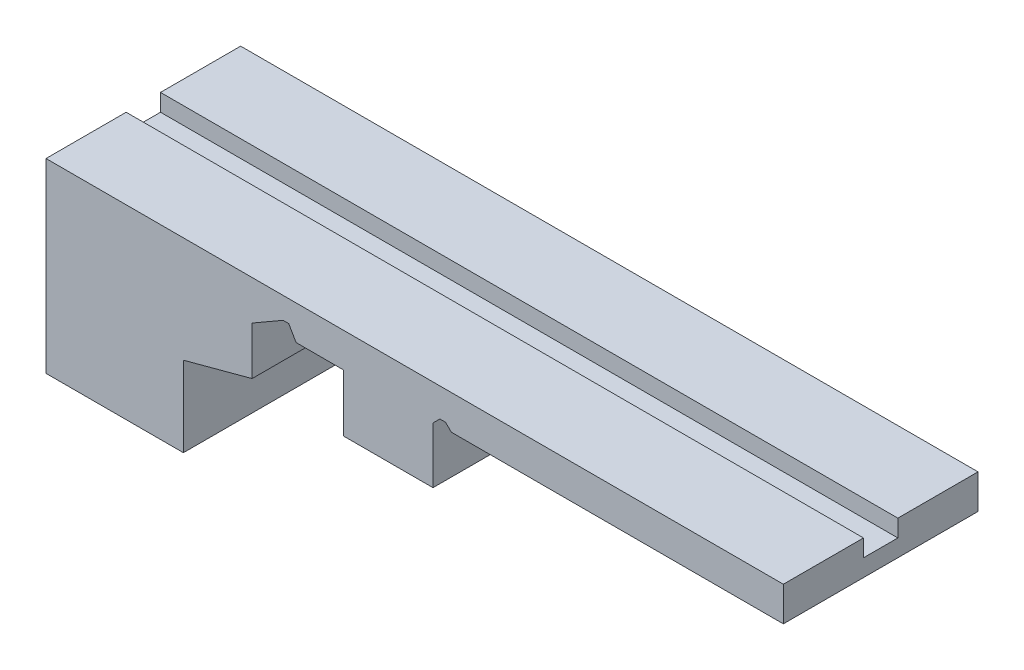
ISO-10303-21;
HEADER;
FILE_DESCRIPTION(('STEP AP214'),'2;1');
FILE_NAME('part.step','',(''),(''),'','','');
FILE_SCHEMA(('AUTOMOTIVE_DESIGN { 1 0 10303 214 1 1 1 1 }'));
ENDSEC;
DATA;
#1=APPLICATION_CONTEXT('core data for automotive mechanical design processes');
#2=APPLICATION_PROTOCOL_DEFINITION('international standard','automotive_design',2000,#1);
#3=PRODUCT_CONTEXT('',#1,'mechanical');
#4=PRODUCT('Part','Part','',(#3));
#5=PRODUCT_RELATED_PRODUCT_CATEGORY('part','',(#4));
#6=PRODUCT_DEFINITION_FORMATION('','',#4);
#7=PRODUCT_DEFINITION_CONTEXT('part definition',#1,'design');
#8=PRODUCT_DEFINITION('design','',#6,#7);
#9=PRODUCT_DEFINITION_SHAPE('','',#8);
#10=(LENGTH_UNIT() NAMED_UNIT(*) SI_UNIT(.MILLI.,.METRE.));
#11=(NAMED_UNIT(*) PLANE_ANGLE_UNIT() SI_UNIT($,.RADIAN.));
#12=(NAMED_UNIT(*) SI_UNIT($,.STERADIAN.) SOLID_ANGLE_UNIT());
#13=UNCERTAINTY_MEASURE_WITH_UNIT(LENGTH_MEASURE(1.E-05),#10,'distance_accuracy_value','');
#14=(GEOMETRIC_REPRESENTATION_CONTEXT(3) GLOBAL_UNCERTAINTY_ASSIGNED_CONTEXT((#13)) GLOBAL_UNIT_ASSIGNED_CONTEXT((#10,
#11,#12)) REPRESENTATION_CONTEXT('',''));
#15=CARTESIAN_POINT('',(0.,0.,0.));
#16=DIRECTION('',(0.,0.,1.));
#17=DIRECTION('',(1.,0.,0.));
#18=AXIS2_PLACEMENT_3D('',#15,#16,#17);
#19=CARTESIAN_POINT('',(-309.002649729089,30.,170.));
#20=DIRECTION('',(0.,-1.,0.));
#21=DIRECTION('',(0.,0.,-1.));
#22=AXIS2_PLACEMENT_3D('',#19,#20,#21);
#23=PLANE('',#22);
#24=DIRECTION('',(0.,0.,-1.));
#25=VECTOR('',#24,1.);
#26=CARTESIAN_POINT('',(-309.002649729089,30.,170.));
#27=LINE('',#26,#25);
#28=CARTESIAN_POINT('',(-309.002649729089,30.,70.));
#29=VERTEX_POINT('',#28);
#30=CARTESIAN_POINT('',(-309.002649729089,30.,0.));
#31=VERTEX_POINT('',#30);
#32=EDGE_CURVE('E318',#29,#31,#27,.T.);
#33=ORIENTED_EDGE('',*,*,#32,.F.);
#34=DIRECTION('',(-1.,0.,0.));
#35=VECTOR('',#34,1.);
#36=CARTESIAN_POINT('',(335.,30.,70.));
#37=LINE('',#36,#35);
#38=CARTESIAN_POINT('',(335.,30.,70.));
#39=VERTEX_POINT('',#38);
#40=EDGE_CURVE('E213',#39,#29,#37,.T.);
#41=ORIENTED_EDGE('',*,*,#40,.F.);
#42=DIRECTION('',(0.,0.,-1.));
#43=VECTOR('',#42,1.);
#44=CARTESIAN_POINT('',(335.,30.,170.));
#45=LINE('',#44,#43);
#46=CARTESIAN_POINT('',(335.,30.,0.));
#47=VERTEX_POINT('',#46);
#48=EDGE_CURVE('E320',#39,#47,#45,.T.);
#49=ORIENTED_EDGE('',*,*,#48,.T.);
#50=DIRECTION('',(-1.,0.,0.));
#51=VECTOR('',#50,1.);
#52=CARTESIAN_POINT('',(-309.002649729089,30.,0.));
#53=LINE('',#52,#51);
#54=EDGE_CURVE('E235',#47,#31,#53,.T.);
#55=ORIENTED_EDGE('',*,*,#54,.T.);
#56=EDGE_LOOP('',(#33,#41,#49,#55));
#57=FACE_BOUND('',#56,.T.);
#58=ADVANCED_FACE('F31',(#57),#23,.F.);
#59=CARTESIAN_POINT('',(-49.,-50.,170.));
#60=DIRECTION('',(1.,0.,0.));
#61=DIRECTION('',(0.,0.,-1.));
#62=AXIS2_PLACEMENT_3D('',#59,#60,#61);
#63=PLANE('',#62);
#64=DIRECTION('',(0.,-1.,0.));
#65=VECTOR('',#64,1.);
#66=CARTESIAN_POINT('',(-49.,-50.,0.));
#67=LINE('',#66,#65);
#68=CARTESIAN_POINT('',(-49.,0.,0.));
#69=VERTEX_POINT('',#68);
#70=CARTESIAN_POINT('',(-49.,-50.,0.));
#71=VERTEX_POINT('',#70);
#72=EDGE_CURVE('E215',#69,#71,#67,.T.);
#73=ORIENTED_EDGE('',*,*,#72,.T.);
#74=DIRECTION('',(0.,0.,-1.));
#75=VECTOR('',#74,1.);
#76=CARTESIAN_POINT('',(-49.,-50.,170.));
#77=LINE('',#76,#75);
#78=CARTESIAN_POINT('',(-49.,-50.,170.));
#79=VERTEX_POINT('',#78);
#80=EDGE_CURVE('E11',#79,#71,#77,.T.);
#81=ORIENTED_EDGE('',*,*,#80,.F.);
#82=DIRECTION('',(0.,-1.,0.));
#83=VECTOR('',#82,1.);
#84=CARTESIAN_POINT('',(-49.,-50.,170.));
#85=LINE('',#84,#83);
#86=CARTESIAN_POINT('',(-49.,0.,170.));
#87=VERTEX_POINT('',#86);
#88=EDGE_CURVE('E256',#87,#79,#85,.T.);
#89=ORIENTED_EDGE('',*,*,#88,.F.);
#90=DIRECTION('',(0.,0.,-1.));
#91=VECTOR('',#90,1.);
#92=CARTESIAN_POINT('',(-49.,0.,170.));
#93=LINE('',#92,#91);
#94=EDGE_CURVE('E291',#87,#69,#93,.T.);
#95=ORIENTED_EDGE('',*,*,#94,.T.);
#96=EDGE_LOOP('',(#73,#81,#89,#95));
#97=FACE_BOUND('',#96,.T.);
#98=ADVANCED_FACE('F33',(#97),#63,.F.);
#99=CARTESIAN_POINT('',(-49.,-50.,170.));
#100=DIRECTION('',(0.,1.,0.));
#101=DIRECTION('',(0.,0.,1.));
#102=AXIS2_PLACEMENT_3D('',#99,#100,#101);
#103=PLANE('',#102);
#104=DIRECTION('',(1.,0.,0.));
#105=VECTOR('',#104,1.);
#106=CARTESIAN_POINT('',(-49.,-50.,0.));
#107=LINE('',#106,#105);
#108=CARTESIAN_POINT('',(29.,-50.,0.));
#109=VERTEX_POINT('',#108);
#110=EDGE_CURVE('E220',#71,#109,#107,.T.);
#111=ORIENTED_EDGE('',*,*,#110,.T.);
#112=DIRECTION('',(0.,0.,-1.));
#113=VECTOR('',#112,1.);
#114=CARTESIAN_POINT('',(29.,-50.,170.));
#115=LINE('',#114,#113);
#116=CARTESIAN_POINT('',(29.,-50.,170.));
#117=VERTEX_POINT('',#116);
#118=EDGE_CURVE('E39',#117,#109,#115,.T.);
#119=ORIENTED_EDGE('',*,*,#118,.F.);
#120=DIRECTION('',(1.,0.,0.));
#121=VECTOR('',#120,1.);
#122=CARTESIAN_POINT('',(-49.,-50.,170.));
#123=LINE('',#122,#121);
#124=EDGE_CURVE('E258',#79,#117,#123,.T.);
#125=ORIENTED_EDGE('',*,*,#124,.F.);
#126=ORIENTED_EDGE('',*,*,#80,.T.);
#127=EDGE_LOOP('',(#111,#119,#125,#126));
#128=FACE_BOUND('',#127,.T.);
#129=ADVANCED_FACE('F365',(#128),#103,.F.);
#130=CARTESIAN_POINT('',(29.,-50.,170.));
#131=DIRECTION('',(-1.,0.,0.));
#132=DIRECTION('',(0.,0.,1.));
#133=AXIS2_PLACEMENT_3D('',#130,#131,#132);
#134=PLANE('',#133);
#135=DIRECTION('',(0.,1.,0.));
#136=VECTOR('',#135,1.);
#137=CARTESIAN_POINT('',(29.,-50.,0.));
#138=LINE('',#137,#136);
#139=CARTESIAN_POINT('',(29.,-0.999999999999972,0.));
#140=VERTEX_POINT('',#139);
#141=EDGE_CURVE('E222',#109,#140,#138,.T.);
#142=ORIENTED_EDGE('',*,*,#141,.T.);
#143=DIRECTION('',(0.,0.,-1.));
#144=VECTOR('',#143,1.);
#145=CARTESIAN_POINT('',(29.,-0.999999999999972,170.));
#146=LINE('',#145,#144);
#147=CARTESIAN_POINT('',(29.,-0.999999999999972,170.));
#148=VERTEX_POINT('',#147);
#149=EDGE_CURVE('E336',#148,#140,#146,.T.);
#150=ORIENTED_EDGE('',*,*,#149,.F.);
#151=DIRECTION('',(0.,1.,0.));
#152=VECTOR('',#151,1.);
#153=CARTESIAN_POINT('',(29.,-50.,170.));
#154=LINE('',#153,#152);
#155=EDGE_CURVE('E260',#117,#148,#154,.T.);
#156=ORIENTED_EDGE('',*,*,#155,.F.);
#157=ORIENTED_EDGE('',*,*,#118,.T.);
#158=EDGE_LOOP('',(#142,#150,#156,#157));
#159=FACE_BOUND('',#158,.T.);
#160=ADVANCED_FACE('F343',(#159),#134,.F.);
#161=CARTESIAN_POINT('',(29.,-0.999999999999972,170.));
#162=DIRECTION('',(-0.707106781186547,0.707106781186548,0.));
#163=DIRECTION('',(-0.707106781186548,-0.707106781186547,0.));
#164=AXIS2_PLACEMENT_3D('',#161,#162,#163);
#165=PLANE('',#164);
#166=DIRECTION('',(0.707106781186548,0.707106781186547,0.));
#167=VECTOR('',#166,1.);
#168=CARTESIAN_POINT('',(29.,-0.999999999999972,0.));
#169=LINE('',#168,#167);
#170=CARTESIAN_POINT('',(35.,5.00000000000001,0.));
#171=VERTEX_POINT('',#170);
#172=EDGE_CURVE('E224',#140,#171,#169,.T.);
#173=ORIENTED_EDGE('',*,*,#172,.T.);
#174=DIRECTION('',(0.,0.,-1.));
#175=VECTOR('',#174,1.);
#176=CARTESIAN_POINT('',(35.,5.00000000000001,170.));
#177=LINE('',#176,#175);
#178=CARTESIAN_POINT('',(35.,5.00000000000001,170.));
#179=VERTEX_POINT('',#178);
#180=EDGE_CURVE('E333',#179,#171,#177,.T.);
#181=ORIENTED_EDGE('',*,*,#180,.F.);
#182=DIRECTION('',(0.707106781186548,0.707106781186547,0.));
#183=VECTOR('',#182,1.);
#184=CARTESIAN_POINT('',(29.,-0.999999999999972,170.));
#185=LINE('',#184,#183);
#186=EDGE_CURVE('E262',#148,#179,#185,.T.);
#187=ORIENTED_EDGE('',*,*,#186,.F.);
#188=ORIENTED_EDGE('',*,*,#149,.T.);
#189=EDGE_LOOP('',(#173,#181,#187,#188));
#190=FACE_BOUND('',#189,.T.);
#191=ADVANCED_FACE('F354',(#190),#165,.F.);
#192=CARTESIAN_POINT('',(35.,5.00000000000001,170.));
#193=DIRECTION('',(0.,1.,0.));
#194=DIRECTION('',(0.,0.,1.));
#195=AXIS2_PLACEMENT_3D('',#192,#193,#194);
#196=PLANE('',#195);
#197=DIRECTION('',(1.,0.,0.));
#198=VECTOR('',#197,1.);
#199=CARTESIAN_POINT('',(35.,5.00000000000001,0.));
#200=LINE('',#199,#198);
#201=CARTESIAN_POINT('',(40.,5.00000000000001,0.));
#202=VERTEX_POINT('',#201);
#203=EDGE_CURVE('E226',#171,#202,#200,.T.);
#204=ORIENTED_EDGE('',*,*,#203,.T.);
#205=DIRECTION('',(0.,0.,-1.));
#206=VECTOR('',#205,1.);
#207=CARTESIAN_POINT('',(40.,5.00000000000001,170.));
#208=LINE('',#207,#206);
#209=CARTESIAN_POINT('',(40.,5.00000000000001,170.));
#210=VERTEX_POINT('',#209);
#211=EDGE_CURVE('E330',#210,#202,#208,.T.);
#212=ORIENTED_EDGE('',*,*,#211,.F.);
#213=DIRECTION('',(1.,0.,0.));
#214=VECTOR('',#213,1.);
#215=CARTESIAN_POINT('',(35.,5.00000000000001,170.));
#216=LINE('',#215,#214);
#217=EDGE_CURVE('E264',#179,#210,#216,.T.);
#218=ORIENTED_EDGE('',*,*,#217,.F.);
#219=ORIENTED_EDGE('',*,*,#180,.T.);
#220=EDGE_LOOP('',(#204,#212,#218,#219));
#221=FACE_BOUND('',#220,.T.);
#222=ADVANCED_FACE('F358',(#221),#196,.F.);
#223=CARTESIAN_POINT('',(40.,5.00000000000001,170.));
#224=DIRECTION('',(0.707106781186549,0.707106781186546,0.));
#225=DIRECTION('',(-0.707106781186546,0.707106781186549,0.));
#226=AXIS2_PLACEMENT_3D('',#223,#224,#225);
#227=PLANE('',#226);
#228=DIRECTION('',(0.707106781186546,-0.707106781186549,0.));
#229=VECTOR('',#228,1.);
#230=CARTESIAN_POINT('',(40.,5.00000000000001,0.));
#231=LINE('',#230,#229);
#232=CARTESIAN_POINT('',(45.,0.,0.));
#233=VERTEX_POINT('',#232);
#234=EDGE_CURVE('E228',#202,#233,#231,.T.);
#235=ORIENTED_EDGE('',*,*,#234,.T.);
#236=DIRECTION('',(0.,0.,-1.));
#237=VECTOR('',#236,1.);
#238=CARTESIAN_POINT('',(45.,0.,170.));
#239=LINE('',#238,#237);
#240=CARTESIAN_POINT('',(45.,0.,170.));
#241=VERTEX_POINT('',#240);
#242=EDGE_CURVE('E327',#241,#233,#239,.T.);
#243=ORIENTED_EDGE('',*,*,#242,.F.);
#244=DIRECTION('',(0.707106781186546,-0.707106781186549,0.));
#245=VECTOR('',#244,1.);
#246=CARTESIAN_POINT('',(40.,5.00000000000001,170.));
#247=LINE('',#246,#245);
#248=EDGE_CURVE('E266',#210,#241,#247,.T.);
#249=ORIENTED_EDGE('',*,*,#248,.F.);
#250=ORIENTED_EDGE('',*,*,#211,.T.);
#251=EDGE_LOOP('',(#235,#243,#249,#250));
#252=FACE_BOUND('',#251,.T.);
#253=ADVANCED_FACE('F423',(#252),#227,.F.);
#254=CARTESIAN_POINT('',(45.,0.,170.));
#255=DIRECTION('',(0.,1.,0.));
#256=DIRECTION('',(0.,0.,1.));
#257=AXIS2_PLACEMENT_3D('',#254,#255,#256);
#258=PLANE('',#257);
#259=DIRECTION('',(1.,0.,0.));
#260=VECTOR('',#259,1.);
#261=CARTESIAN_POINT('',(45.,0.,0.));
#262=LINE('',#261,#260);
#263=CARTESIAN_POINT('',(335.,0.,0.));
#264=VERTEX_POINT('',#263);
#265=EDGE_CURVE('E230',#233,#264,#262,.T.);
#266=ORIENTED_EDGE('',*,*,#265,.T.);
#267=DIRECTION('',(0.,0.,-1.));
#268=VECTOR('',#267,1.);
#269=CARTESIAN_POINT('',(335.,0.,170.));
#270=LINE('',#269,#268);
#271=CARTESIAN_POINT('',(335.,0.,170.));
#272=VERTEX_POINT('',#271);
#273=EDGE_CURVE('E324',#272,#264,#270,.T.);
#274=ORIENTED_EDGE('',*,*,#273,.F.);
#275=DIRECTION('',(1.,0.,0.));
#276=VECTOR('',#275,1.);
#277=CARTESIAN_POINT('',(45.,0.,170.));
#278=LINE('',#277,#276);
#279=EDGE_CURVE('E268',#241,#272,#278,.T.);
#280=ORIENTED_EDGE('',*,*,#279,.F.);
#281=ORIENTED_EDGE('',*,*,#242,.T.);
#282=EDGE_LOOP('',(#266,#274,#280,#281));
#283=FACE_BOUND('',#282,.T.);
#284=ADVANCED_FACE('F421',(#283),#258,.F.);
#285=CARTESIAN_POINT('',(335.,30.,170.));
#286=DIRECTION('',(-1.,0.,0.));
#287=DIRECTION('',(0.,0.,1.));
#288=AXIS2_PLACEMENT_3D('',#285,#286,#287);
#289=PLANE('',#288);
#290=ORIENTED_EDGE('',*,*,#48,.F.);
#291=DIRECTION('',(0.,-1.,0.));
#292=VECTOR('',#291,1.);
#293=CARTESIAN_POINT('',(335.,30.,70.));
#294=LINE('',#293,#292);
#295=CARTESIAN_POINT('',(335.,15.,70.));
#296=VERTEX_POINT('',#295);
#297=EDGE_CURVE('E204',#39,#296,#294,.T.);
#298=ORIENTED_EDGE('',*,*,#297,.T.);
#299=DIRECTION('',(0.,0.,1.));
#300=VECTOR('',#299,1.);
#301=CARTESIAN_POINT('',(335.,15.,70.));
#302=LINE('',#301,#300);
#303=CARTESIAN_POINT('',(335.,15.,100.));
#304=VERTEX_POINT('',#303);
#305=EDGE_CURVE('E207',#296,#304,#302,.T.);
#306=ORIENTED_EDGE('',*,*,#305,.T.);
#307=DIRECTION('',(0.,1.,0.));
#308=VECTOR('',#307,1.);
#309=CARTESIAN_POINT('',(335.,30.,100.));
#310=LINE('',#309,#308);
#311=CARTESIAN_POINT('',(335.,30.,100.));
#312=VERTEX_POINT('',#311);
#313=EDGE_CURVE('E187',#304,#312,#310,.T.);
#314=ORIENTED_EDGE('',*,*,#313,.T.);
#315=CARTESIAN_POINT('',(335.,30.,170.));
#316=VERTEX_POINT('',#315);
#317=EDGE_CURVE('E321',#316,#312,#45,.T.);
#318=ORIENTED_EDGE('',*,*,#317,.F.);
#319=DIRECTION('',(0.,1.,0.));
#320=VECTOR('',#319,1.);
#321=CARTESIAN_POINT('',(335.,30.,170.));
#322=LINE('',#321,#320);
#323=EDGE_CURVE('E270',#272,#316,#322,.T.);
#324=ORIENTED_EDGE('',*,*,#323,.F.);
#325=ORIENTED_EDGE('',*,*,#273,.T.);
#326=DIRECTION('',(0.,1.,0.));
#327=VECTOR('',#326,1.);
#328=CARTESIAN_POINT('',(335.,30.,0.));
#329=LINE('',#328,#327);
#330=EDGE_CURVE('E232',#264,#47,#329,.T.);
#331=ORIENTED_EDGE('',*,*,#330,.T.);
#332=EDGE_LOOP('',(#290,#298,#306,#314,#318,#324,#325,#331));
#333=FACE_BOUND('',#332,.T.);
#334=ADVANCED_FACE('F415',(#333),#289,.F.);
#335=ORIENTED_EDGE('',*,*,#317,.T.);
#336=DIRECTION('',(-1.,0.,0.));
#337=VECTOR('',#336,1.);
#338=CARTESIAN_POINT('',(335.,30.,100.));
#339=LINE('',#338,#337);
#340=CARTESIAN_POINT('',(-309.002649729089,30.,100.));
#341=VERTEX_POINT('',#340);
#342=EDGE_CURVE('E191',#312,#341,#339,.T.);
#343=ORIENTED_EDGE('',*,*,#342,.T.);
#344=CARTESIAN_POINT('',(-309.002649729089,30.,170.));
#345=VERTEX_POINT('',#344);
#346=EDGE_CURVE('E203',#345,#341,#27,.T.);
#347=ORIENTED_EDGE('',*,*,#346,.F.);
#348=DIRECTION('',(-1.,0.,0.));
#349=VECTOR('',#348,1.);
#350=CARTESIAN_POINT('',(-309.002649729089,30.,170.));
#351=LINE('',#350,#349);
#352=EDGE_CURVE('E272',#316,#345,#351,.T.);
#353=ORIENTED_EDGE('',*,*,#352,.F.);
#354=EDGE_LOOP('',(#335,#343,#347,#353));
#355=FACE_BOUND('',#354,.T.);
#356=ADVANCED_FACE('F434',(#355),#23,.F.);
#357=CARTESIAN_POINT('',(-309.002649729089,-132.541053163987,170.));
#358=DIRECTION('',(1.,0.,0.));
#359=DIRECTION('',(0.,0.,-1.));
#360=AXIS2_PLACEMENT_3D('',#357,#358,#359);
#361=PLANE('',#360);
#362=DIRECTION('',(0.,0.,1.));
#363=VECTOR('',#362,1.);
#364=CARTESIAN_POINT('',(-309.002649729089,15.,70.));
#365=LINE('',#364,#363);
#366=CARTESIAN_POINT('',(-309.002649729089,15.,70.));
#367=VERTEX_POINT('',#366);
#368=CARTESIAN_POINT('',(-309.002649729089,15.,100.));
#369=VERTEX_POINT('',#368);
#370=EDGE_CURVE('E195',#367,#369,#365,.T.);
#371=ORIENTED_EDGE('',*,*,#370,.F.);
#372=DIRECTION('',(0.,-1.,0.));
#373=VECTOR('',#372,1.);
#374=CARTESIAN_POINT('',(-309.002649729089,30.,70.));
#375=LINE('',#374,#373);
#376=EDGE_CURVE('E46',#29,#367,#375,.T.);
#377=ORIENTED_EDGE('',*,*,#376,.F.);
#378=ORIENTED_EDGE('',*,*,#32,.T.);
#379=DIRECTION('',(0.,-1.,0.));
#380=VECTOR('',#379,1.);
#381=CARTESIAN_POINT('',(-309.002649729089,-132.541053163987,0.));
#382=LINE('',#381,#380);
#383=CARTESIAN_POINT('',(-309.002649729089,-132.541053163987,0.));
#384=VERTEX_POINT('',#383);
#385=EDGE_CURVE('E238',#31,#384,#382,.T.);
#386=ORIENTED_EDGE('',*,*,#385,.T.);
#387=DIRECTION('',(0.,0.,-1.));
#388=VECTOR('',#387,1.);
#389=CARTESIAN_POINT('',(-309.002649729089,-132.541053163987,170.));
#390=LINE('',#389,#388);
#391=CARTESIAN_POINT('',(-309.002649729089,-132.541053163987,170.));
#392=VERTEX_POINT('',#391);
#393=EDGE_CURVE('E315',#392,#384,#390,.T.);
#394=ORIENTED_EDGE('',*,*,#393,.F.);
#395=DIRECTION('',(0.,-1.,0.));
#396=VECTOR('',#395,1.);
#397=CARTESIAN_POINT('',(-309.002649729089,-132.541053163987,170.));
#398=LINE('',#397,#396);
#399=EDGE_CURVE('E274',#345,#392,#398,.T.);
#400=ORIENTED_EDGE('',*,*,#399,.F.);
#401=ORIENTED_EDGE('',*,*,#346,.T.);
#402=DIRECTION('',(0.,1.,0.));
#403=VECTOR('',#402,1.);
#404=CARTESIAN_POINT('',(-309.002649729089,30.,100.));
#405=LINE('',#404,#403);
#406=EDGE_CURVE('E184',#369,#341,#405,.T.);
#407=ORIENTED_EDGE('',*,*,#406,.F.);
#408=EDGE_LOOP('',(#371,#377,#378,#386,#394,#400,#401,#407));
#409=FACE_BOUND('',#408,.T.);
#410=ADVANCED_FACE('F200',(#409),#361,.F.);
#411=CARTESIAN_POINT('',(-189.002649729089,-132.541053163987,170.));
#412=DIRECTION('',(0.,1.,0.));
#413=DIRECTION('',(0.,0.,1.));
#414=AXIS2_PLACEMENT_3D('',#411,#412,#413);
#415=PLANE('',#414);
#416=DIRECTION('',(1.,0.,0.));
#417=VECTOR('',#416,1.);
#418=CARTESIAN_POINT('',(-189.002649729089,-132.541053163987,0.));
#419=LINE('',#418,#417);
#420=CARTESIAN_POINT('',(-189.002649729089,-132.541053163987,0.));
#421=VERTEX_POINT('',#420);
#422=EDGE_CURVE('E240',#384,#421,#419,.T.);
#423=ORIENTED_EDGE('',*,*,#422,.T.);
#424=DIRECTION('',(0.,0.,-1.));
#425=VECTOR('',#424,1.);
#426=CARTESIAN_POINT('',(-189.002649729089,-132.541053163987,170.));
#427=LINE('',#426,#425);
#428=CARTESIAN_POINT('',(-189.002649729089,-132.541053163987,170.));
#429=VERTEX_POINT('',#428);
#430=EDGE_CURVE('E312',#429,#421,#427,.T.);
#431=ORIENTED_EDGE('',*,*,#430,.F.);
#432=DIRECTION('',(1.,0.,0.));
#433=VECTOR('',#432,1.);
#434=CARTESIAN_POINT('',(-189.002649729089,-132.541053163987,170.));
#435=LINE('',#434,#433);
#436=EDGE_CURVE('E276',#392,#429,#435,.T.);
#437=ORIENTED_EDGE('',*,*,#436,.F.);
#438=ORIENTED_EDGE('',*,*,#393,.T.);
#439=EDGE_LOOP('',(#423,#431,#437,#438));
#440=FACE_BOUND('',#439,.T.);
#441=ADVANCED_FACE('F405',(#440),#415,.F.);
#442=CARTESIAN_POINT('',(-189.002649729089,-62.5410531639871,170.));
#443=DIRECTION('',(-1.,0.,0.));
#444=DIRECTION('',(0.,-1.,0.));
#445=AXIS2_PLACEMENT_3D('',#442,#443,#444);
#446=PLANE('',#445);
#447=DIRECTION('',(0.,1.,0.));
#448=VECTOR('',#447,1.);
#449=CARTESIAN_POINT('',(-189.002649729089,-62.5410531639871,0.));
#450=LINE('',#449,#448);
#451=CARTESIAN_POINT('',(-189.002649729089,-62.5410531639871,0.));
#452=VERTEX_POINT('',#451);
#453=EDGE_CURVE('E242',#421,#452,#450,.T.);
#454=ORIENTED_EDGE('',*,*,#453,.T.);
#455=DIRECTION('',(0.,0.,-1.));
#456=VECTOR('',#455,1.);
#457=CARTESIAN_POINT('',(-189.002649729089,-62.5410531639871,170.));
#458=LINE('',#457,#456);
#459=CARTESIAN_POINT('',(-189.002649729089,-62.5410531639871,170.));
#460=VERTEX_POINT('',#459);
#461=EDGE_CURVE('E309',#460,#452,#458,.T.);
#462=ORIENTED_EDGE('',*,*,#461,.F.);
#463=DIRECTION('',(0.,1.,0.));
#464=VECTOR('',#463,1.);
#465=CARTESIAN_POINT('',(-189.002649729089,-62.5410531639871,170.));
#466=LINE('',#465,#464);
#467=EDGE_CURVE('E278',#429,#460,#466,.T.);
#468=ORIENTED_EDGE('',*,*,#467,.F.);
#469=ORIENTED_EDGE('',*,*,#430,.T.);
#470=EDGE_LOOP('',(#454,#462,#468,#469));
#471=FACE_BOUND('',#470,.T.);
#472=ADVANCED_FACE('F400',(#471),#446,.F.);
#473=CARTESIAN_POINT('',(-129.002649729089,-46.46410161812,170.));
#474=DIRECTION('',(-0.258819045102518,0.965925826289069,0.));
#475=DIRECTION('',(-0.965925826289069,-0.258819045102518,0.));
#476=AXIS2_PLACEMENT_3D('',#473,#474,#475);
#477=PLANE('',#476);
#478=DIRECTION('',(0.965925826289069,0.258819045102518,0.));
#479=VECTOR('',#478,1.);
#480=CARTESIAN_POINT('',(-129.002649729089,-46.46410161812,0.));
#481=LINE('',#480,#479);
#482=CARTESIAN_POINT('',(-129.002649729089,-46.46410161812,0.));
#483=VERTEX_POINT('',#482);
#484=EDGE_CURVE('E244',#452,#483,#481,.T.);
#485=ORIENTED_EDGE('',*,*,#484,.T.);
#486=DIRECTION('',(0.,0.,-1.));
#487=VECTOR('',#486,1.);
#488=CARTESIAN_POINT('',(-129.002649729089,-46.46410161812,170.));
#489=LINE('',#488,#487);
#490=CARTESIAN_POINT('',(-129.002649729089,-46.46410161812,170.));
#491=VERTEX_POINT('',#490);
#492=EDGE_CURVE('E306',#491,#483,#489,.T.);
#493=ORIENTED_EDGE('',*,*,#492,.F.);
#494=DIRECTION('',(0.965925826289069,0.258819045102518,0.));
#495=VECTOR('',#494,1.);
#496=CARTESIAN_POINT('',(-129.002649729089,-46.46410161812,170.));
#497=LINE('',#496,#495);
#498=EDGE_CURVE('E280',#460,#491,#497,.T.);
#499=ORIENTED_EDGE('',*,*,#498,.F.);
#500=ORIENTED_EDGE('',*,*,#461,.T.);
#501=EDGE_LOOP('',(#485,#493,#499,#500));
#502=FACE_BOUND('',#501,.T.);
#503=ADVANCED_FACE('F394',(#502),#477,.F.);
#504=CARTESIAN_POINT('',(-129.002649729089,-4.46410161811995,170.));
#505=DIRECTION('',(-1.,0.,0.));
#506=DIRECTION('',(0.,0.,1.));
#507=AXIS2_PLACEMENT_3D('',#504,#505,#506);
#508=PLANE('',#507);
#509=DIRECTION('',(0.,1.,0.));
#510=VECTOR('',#509,1.);
#511=CARTESIAN_POINT('',(-129.002649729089,-4.46410161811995,0.));
#512=LINE('',#511,#510);
#513=CARTESIAN_POINT('',(-129.002649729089,-4.46410161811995,0.));
#514=VERTEX_POINT('',#513);
#515=EDGE_CURVE('E246',#483,#514,#512,.T.);
#516=ORIENTED_EDGE('',*,*,#515,.T.);
#517=DIRECTION('',(0.,0.,-1.));
#518=VECTOR('',#517,1.);
#519=CARTESIAN_POINT('',(-129.002649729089,-4.46410161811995,170.));
#520=LINE('',#519,#518);
#521=CARTESIAN_POINT('',(-129.002649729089,-4.46410161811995,170.));
#522=VERTEX_POINT('',#521);
#523=EDGE_CURVE('E303',#522,#514,#520,.T.);
#524=ORIENTED_EDGE('',*,*,#523,.F.);
#525=DIRECTION('',(0.,1.,0.));
#526=VECTOR('',#525,1.);
#527=CARTESIAN_POINT('',(-129.002649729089,-4.46410161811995,170.));
#528=LINE('',#527,#526);
#529=EDGE_CURVE('E282',#491,#522,#528,.T.);
#530=ORIENTED_EDGE('',*,*,#529,.F.);
#531=ORIENTED_EDGE('',*,*,#492,.T.);
#532=EDGE_LOOP('',(#516,#524,#530,#531));
#533=FACE_BOUND('',#532,.T.);
#534=ADVANCED_FACE('F390',(#533),#508,.F.);
#535=CARTESIAN_POINT('',(-102.002649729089,11.12435565,170.));
#536=DIRECTION('',(-0.500000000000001,0.866025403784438,0.));
#537=DIRECTION('',(-0.866025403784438,-0.500000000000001,0.));
#538=AXIS2_PLACEMENT_3D('',#535,#536,#537);
#539=PLANE('',#538);
#540=DIRECTION('',(0.866025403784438,0.500000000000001,0.));
#541=VECTOR('',#540,1.);
#542=CARTESIAN_POINT('',(-102.002649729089,11.12435565,0.));
#543=LINE('',#542,#541);
#544=CARTESIAN_POINT('',(-102.002649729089,11.12435565,0.));
#545=VERTEX_POINT('',#544);
#546=EDGE_CURVE('E248',#514,#545,#543,.T.);
#547=ORIENTED_EDGE('',*,*,#546,.T.);
#548=DIRECTION('',(0.,0.,-1.));
#549=VECTOR('',#548,1.);
#550=CARTESIAN_POINT('',(-102.002649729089,11.12435565,170.));
#551=LINE('',#550,#549);
#552=CARTESIAN_POINT('',(-102.002649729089,11.12435565,170.));
#553=VERTEX_POINT('',#552);
#554=EDGE_CURVE('E300',#553,#545,#551,.T.);
#555=ORIENTED_EDGE('',*,*,#554,.F.);
#556=DIRECTION('',(0.866025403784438,0.500000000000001,0.));
#557=VECTOR('',#556,1.);
#558=CARTESIAN_POINT('',(-102.002649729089,11.12435565,170.));
#559=LINE('',#558,#557);
#560=EDGE_CURVE('E284',#522,#553,#559,.T.);
#561=ORIENTED_EDGE('',*,*,#560,.F.);
#562=ORIENTED_EDGE('',*,*,#523,.T.);
#563=EDGE_LOOP('',(#547,#555,#561,#562));
#564=FACE_BOUND('',#563,.T.);
#565=ADVANCED_FACE('F385',(#564),#539,.F.);
#566=CARTESIAN_POINT('',(-97.0026497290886,11.12435565,170.));
#567=DIRECTION('',(0.,1.,0.));
#568=DIRECTION('',(0.,0.,1.));
#569=AXIS2_PLACEMENT_3D('',#566,#567,#568);
#570=PLANE('',#569);
#571=DIRECTION('',(1.,0.,0.));
#572=VECTOR('',#571,1.);
#573=CARTESIAN_POINT('',(-97.0026497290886,11.12435565,0.));
#574=LINE('',#573,#572);
#575=CARTESIAN_POINT('',(-97.0026497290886,11.12435565,0.));
#576=VERTEX_POINT('',#575);
#577=EDGE_CURVE('E250',#545,#576,#574,.T.);
#578=ORIENTED_EDGE('',*,*,#577,.T.);
#579=DIRECTION('',(0.,0.,-1.));
#580=VECTOR('',#579,1.);
#581=CARTESIAN_POINT('',(-97.0026497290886,11.12435565,170.));
#582=LINE('',#581,#580);
#583=CARTESIAN_POINT('',(-97.0026497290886,11.12435565,170.));
#584=VERTEX_POINT('',#583);
#585=EDGE_CURVE('E297',#584,#576,#582,.T.);
#586=ORIENTED_EDGE('',*,*,#585,.F.);
#587=DIRECTION('',(1.,0.,0.));
#588=VECTOR('',#587,1.);
#589=CARTESIAN_POINT('',(-97.0026497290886,11.12435565,170.));
#590=LINE('',#589,#588);
#591=EDGE_CURVE('E286',#553,#584,#590,.T.);
#592=ORIENTED_EDGE('',*,*,#591,.F.);
#593=ORIENTED_EDGE('',*,*,#554,.T.);
#594=EDGE_LOOP('',(#578,#586,#592,#593));
#595=FACE_BOUND('',#594,.T.);
#596=ADVANCED_FACE('F379',(#595),#570,.F.);
#597=CARTESIAN_POINT('',(-90.58,0.,170.));
#598=DIRECTION('',(0.86602540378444,0.499999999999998,0.));
#599=DIRECTION('',(-0.499999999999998,0.86602540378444,0.));
#600=AXIS2_PLACEMENT_3D('',#597,#598,#599);
#601=PLANE('',#600);
#602=DIRECTION('',(0.499999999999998,-0.86602540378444,0.));
#603=VECTOR('',#602,1.);
#604=CARTESIAN_POINT('',(-90.58,0.,0.));
#605=LINE('',#604,#603);
#606=CARTESIAN_POINT('',(-90.58,0.,0.));
#607=VERTEX_POINT('',#606);
#608=EDGE_CURVE('E252',#576,#607,#605,.T.);
#609=ORIENTED_EDGE('',*,*,#608,.T.);
#610=DIRECTION('',(0.,0.,-1.));
#611=VECTOR('',#610,1.);
#612=CARTESIAN_POINT('',(-90.58,0.,170.));
#613=LINE('',#612,#611);
#614=CARTESIAN_POINT('',(-90.58,0.,170.));
#615=VERTEX_POINT('',#614);
#616=EDGE_CURVE('E294',#615,#607,#613,.T.);
#617=ORIENTED_EDGE('',*,*,#616,.F.);
#618=DIRECTION('',(0.499999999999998,-0.86602540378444,0.));
#619=VECTOR('',#618,1.);
#620=CARTESIAN_POINT('',(-90.58,0.,170.));
#621=LINE('',#620,#619);
#622=EDGE_CURVE('E288',#584,#615,#621,.T.);
#623=ORIENTED_EDGE('',*,*,#622,.F.);
#624=ORIENTED_EDGE('',*,*,#585,.T.);
#625=EDGE_LOOP('',(#609,#617,#623,#624));
#626=FACE_BOUND('',#625,.T.);
#627=ADVANCED_FACE('F375',(#626),#601,.F.);
#628=CARTESIAN_POINT('',(-49.,0.,170.));
#629=DIRECTION('',(0.,1.,0.));
#630=DIRECTION('',(-1.,0.,0.));
#631=AXIS2_PLACEMENT_3D('',#628,#629,#630);
#632=PLANE('',#631);
#633=DIRECTION('',(1.,0.,0.));
#634=VECTOR('',#633,1.);
#635=CARTESIAN_POINT('',(-49.,0.,0.));
#636=LINE('',#635,#634);
#637=EDGE_CURVE('E254',#607,#69,#636,.T.);
#638=ORIENTED_EDGE('',*,*,#637,.T.);
#639=ORIENTED_EDGE('',*,*,#94,.F.);
#640=DIRECTION('',(1.,0.,0.));
#641=VECTOR('',#640,1.);
#642=CARTESIAN_POINT('',(-49.,0.,170.));
#643=LINE('',#642,#641);
#644=EDGE_CURVE('E54',#615,#87,#643,.T.);
#645=ORIENTED_EDGE('',*,*,#644,.F.);
#646=ORIENTED_EDGE('',*,*,#616,.T.);
#647=EDGE_LOOP('',(#638,#639,#645,#646));
#648=FACE_BOUND('',#647,.T.);
#649=ADVANCED_FACE('F371',(#648),#632,.F.);
#650=CARTESIAN_POINT('',(-49.,11.12435565,170.));
#651=DIRECTION('',(0.,0.,1.));
#652=DIRECTION('',(1.,0.,0.));
#653=AXIS2_PLACEMENT_3D('',#650,#651,#652);
#654=PLANE('',#653);
#655=ORIENTED_EDGE('',*,*,#88,.T.);
#656=ORIENTED_EDGE('',*,*,#124,.T.);
#657=ORIENTED_EDGE('',*,*,#155,.T.);
#658=ORIENTED_EDGE('',*,*,#186,.T.);
#659=ORIENTED_EDGE('',*,*,#217,.T.);
#660=ORIENTED_EDGE('',*,*,#248,.T.);
#661=ORIENTED_EDGE('',*,*,#279,.T.);
#662=ORIENTED_EDGE('',*,*,#323,.T.);
#663=ORIENTED_EDGE('',*,*,#352,.T.);
#664=ORIENTED_EDGE('',*,*,#399,.T.);
#665=ORIENTED_EDGE('',*,*,#436,.T.);
#666=ORIENTED_EDGE('',*,*,#467,.T.);
#667=ORIENTED_EDGE('',*,*,#498,.T.);
#668=ORIENTED_EDGE('',*,*,#529,.T.);
#669=ORIENTED_EDGE('',*,*,#560,.T.);
#670=ORIENTED_EDGE('',*,*,#591,.T.);
#671=ORIENTED_EDGE('',*,*,#622,.T.);
#672=ORIENTED_EDGE('',*,*,#644,.T.);
#673=EDGE_LOOP('',(#655,#656,#657,#658,#659,#660,#661,#662,#663,#664,#665,#666,#667,#668,#669,
#670,#671,#672));
#674=FACE_BOUND('',#673,.T.);
#675=ADVANCED_FACE('F361',(#674),#654,.T.);
#676=CARTESIAN_POINT('',(-49.,11.12435565,0.));
#677=DIRECTION('',(0.,0.,1.));
#678=DIRECTION('',(1.,0.,0.));
#679=AXIS2_PLACEMENT_3D('',#676,#677,#678);
#680=PLANE('',#679);
#681=ORIENTED_EDGE('',*,*,#72,.F.);
#682=ORIENTED_EDGE('',*,*,#637,.F.);
#683=ORIENTED_EDGE('',*,*,#608,.F.);
#684=ORIENTED_EDGE('',*,*,#577,.F.);
#685=ORIENTED_EDGE('',*,*,#546,.F.);
#686=ORIENTED_EDGE('',*,*,#515,.F.);
#687=ORIENTED_EDGE('',*,*,#484,.F.);
#688=ORIENTED_EDGE('',*,*,#453,.F.);
#689=ORIENTED_EDGE('',*,*,#422,.F.);
#690=ORIENTED_EDGE('',*,*,#385,.F.);
#691=ORIENTED_EDGE('',*,*,#54,.F.);
#692=ORIENTED_EDGE('',*,*,#330,.F.);
#693=ORIENTED_EDGE('',*,*,#265,.F.);
#694=ORIENTED_EDGE('',*,*,#234,.F.);
#695=ORIENTED_EDGE('',*,*,#203,.F.);
#696=ORIENTED_EDGE('',*,*,#172,.F.);
#697=ORIENTED_EDGE('',*,*,#141,.F.);
#698=ORIENTED_EDGE('',*,*,#110,.F.);
#699=EDGE_LOOP('',(#681,#682,#683,#684,#685,#686,#687,#688,#689,#690,#691,#692,#693,#694,#695,
#696,#697,#698));
#700=FACE_BOUND('',#699,.T.);
#701=ADVANCED_FACE('F349',(#700),#680,.F.);
#702=CARTESIAN_POINT('',(335.,30.,70.));
#703=DIRECTION('',(0.,0.,-1.));
#704=DIRECTION('',(-1.,0.,0.));
#705=AXIS2_PLACEMENT_3D('',#702,#703,#704);
#706=PLANE('',#705);
#707=ORIENTED_EDGE('',*,*,#376,.T.);
#708=DIRECTION('',(-1.,0.,0.));
#709=VECTOR('',#708,1.);
#710=CARTESIAN_POINT('',(335.,15.,70.));
#711=LINE('',#710,#709);
#712=EDGE_CURVE('E192',#296,#367,#711,.T.);
#713=ORIENTED_EDGE('',*,*,#712,.F.);
#714=ORIENTED_EDGE('',*,*,#297,.F.);
#715=ORIENTED_EDGE('',*,*,#40,.T.);
#716=EDGE_LOOP('',(#707,#713,#714,#715));
#717=FACE_BOUND('',#716,.T.);
#718=ADVANCED_FACE('F447',(#717),#706,.F.);
#719=CARTESIAN_POINT('',(335.,30.,100.));
#720=DIRECTION('',(0.,0.,1.));
#721=DIRECTION('',(1.,0.,0.));
#722=AXIS2_PLACEMENT_3D('',#719,#720,#721);
#723=PLANE('',#722);
#724=ORIENTED_EDGE('',*,*,#406,.T.);
#725=ORIENTED_EDGE('',*,*,#342,.F.);
#726=ORIENTED_EDGE('',*,*,#313,.F.);
#727=DIRECTION('',(-1.,0.,0.));
#728=VECTOR('',#727,1.);
#729=CARTESIAN_POINT('',(335.,15.,100.));
#730=LINE('',#729,#728);
#731=EDGE_CURVE('E180',#304,#369,#730,.T.);
#732=ORIENTED_EDGE('',*,*,#731,.T.);
#733=EDGE_LOOP('',(#724,#725,#726,#732));
#734=FACE_BOUND('',#733,.T.);
#735=ADVANCED_FACE('F182',(#734),#723,.F.);
#736=CARTESIAN_POINT('',(335.,15.,70.));
#737=DIRECTION('',(0.,-1.,0.));
#738=DIRECTION('',(0.,0.,-1.));
#739=AXIS2_PLACEMENT_3D('',#736,#737,#738);
#740=PLANE('',#739);
#741=ORIENTED_EDGE('',*,*,#370,.T.);
#742=ORIENTED_EDGE('',*,*,#731,.F.);
#743=ORIENTED_EDGE('',*,*,#305,.F.);
#744=ORIENTED_EDGE('',*,*,#712,.T.);
#745=EDGE_LOOP('',(#741,#742,#743,#744));
#746=FACE_BOUND('',#745,.T.);
#747=ADVANCED_FACE('F196',(#746),#740,.F.);
#748=CLOSED_SHELL('',(#58,#98,#129,#160,#191,#222,#253,#284,#334,#356,#410,#441,#472,#503,#534,
#565,#596,#627,#649,#675,#701,#718,#735,#747));
#749=MANIFOLD_SOLID_BREP('B2',#748);
#750=ADVANCED_BREP_SHAPE_REPRESENTATION('',(#18,#749),#14);
#751=SHAPE_DEFINITION_REPRESENTATION(#9,#750);
ENDSEC;
END-ISO-10303-21;
